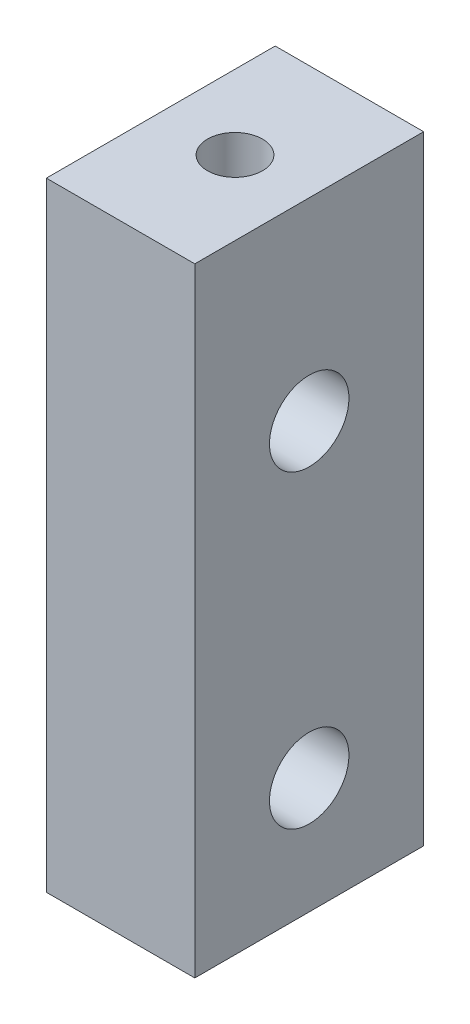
ISO-10303-21;
HEADER;
FILE_DESCRIPTION(('STEP AP214'),'2;1');
FILE_NAME('part.step','',(''),(''),'','','');
FILE_SCHEMA(('AUTOMOTIVE_DESIGN { 1 0 10303 214 1 1 1 1 }'));
ENDSEC;
DATA;
#1=APPLICATION_CONTEXT('core data for automotive mechanical design processes');
#2=APPLICATION_PROTOCOL_DEFINITION('international standard','automotive_design',2000,#1);
#3=PRODUCT_CONTEXT('',#1,'mechanical');
#4=PRODUCT('Part','Part','',(#3));
#5=PRODUCT_RELATED_PRODUCT_CATEGORY('part','',(#4));
#6=PRODUCT_DEFINITION_FORMATION('','',#4);
#7=PRODUCT_DEFINITION_CONTEXT('part definition',#1,'design');
#8=PRODUCT_DEFINITION('design','',#6,#7);
#9=PRODUCT_DEFINITION_SHAPE('','',#8);
#10=(LENGTH_UNIT() NAMED_UNIT(*) SI_UNIT(.MILLI.,.METRE.));
#11=(NAMED_UNIT(*) PLANE_ANGLE_UNIT() SI_UNIT($,.RADIAN.));
#12=(NAMED_UNIT(*) SI_UNIT($,.STERADIAN.) SOLID_ANGLE_UNIT());
#13=UNCERTAINTY_MEASURE_WITH_UNIT(LENGTH_MEASURE(1.E-05),#10,'distance_accuracy_value','');
#14=(GEOMETRIC_REPRESENTATION_CONTEXT(3) GLOBAL_UNCERTAINTY_ASSIGNED_CONTEXT((#13)) GLOBAL_UNIT_ASSIGNED_CONTEXT((#10,
#11,#12)) REPRESENTATION_CONTEXT('',''));
#15=CARTESIAN_POINT('',(0.,0.,0.));
#16=DIRECTION('',(0.,0.,1.));
#17=DIRECTION('',(1.,0.,0.));
#18=AXIS2_PLACEMENT_3D('',#15,#16,#17);
#19=CARTESIAN_POINT('',(6.096,0.,0.));
#20=DIRECTION('',(0.,0.,-0.999999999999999));
#21=DIRECTION('',(0.,0.999999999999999,0.));
#22=AXIS2_PLACEMENT_3D('',#19,#20,#21);
#23=PLANE('',#22);
#24=DIRECTION('',(0.,-0.999999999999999,0.));
#25=VECTOR('',#24,1.);
#26=CARTESIAN_POINT('',(0.,0.,0.));
#27=LINE('',#26,#25);
#28=CARTESIAN_POINT('',(0.,0.,0.));
#29=VERTEX_POINT('',#28);
#30=CARTESIAN_POINT('',(0.,-25.4,0.));
#31=VERTEX_POINT('',#30);
#32=EDGE_CURVE('E133',#29,#31,#27,.T.);
#33=ORIENTED_EDGE('',*,*,#32,.T.);
#34=DIRECTION('',(-1.,0.,0.));
#35=VECTOR('',#34,1.);
#36=CARTESIAN_POINT('',(6.09599999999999,-25.4,0.));
#37=LINE('',#36,#35);
#38=CARTESIAN_POINT('',(6.09599999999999,-25.4,0.));
#39=VERTEX_POINT('',#38);
#40=EDGE_CURVE('E11',#39,#31,#37,.T.);
#41=ORIENTED_EDGE('',*,*,#40,.F.);
#42=DIRECTION('',(0.,-0.999999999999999,0.));
#43=VECTOR('',#42,1.);
#44=CARTESIAN_POINT('',(6.096,0.,0.));
#45=LINE('',#44,#43);
#46=CARTESIAN_POINT('',(6.096,0.,0.));
#47=VERTEX_POINT('',#46);
#48=EDGE_CURVE('E134',#47,#39,#45,.T.);
#49=ORIENTED_EDGE('',*,*,#48,.F.);
#50=DIRECTION('',(-1.,0.,0.));
#51=VECTOR('',#50,1.);
#52=CARTESIAN_POINT('',(6.096,0.,0.));
#53=LINE('',#52,#51);
#54=EDGE_CURVE('E143',#47,#29,#53,.T.);
#55=ORIENTED_EDGE('',*,*,#54,.T.);
#56=EDGE_LOOP('',(#33,#41,#49,#55));
#57=FACE_BOUND('',#56,.T.);
#58=ADVANCED_FACE('F46',(#57),#23,.F.);
#59=CARTESIAN_POINT('',(6.09599999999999,-25.4,0.));
#60=DIRECTION('',(0.,0.999999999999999,0.));
#61=DIRECTION('',(0.,0.,0.999999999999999));
#62=AXIS2_PLACEMENT_3D('',#59,#60,#61);
#63=PLANE('',#62);
#64=DIRECTION('',(0.,0.,-0.999999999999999));
#65=VECTOR('',#64,1.);
#66=CARTESIAN_POINT('',(0.,-25.4,0.));
#67=LINE('',#66,#65);
#68=CARTESIAN_POINT('',(0.,-25.4,-9.39799999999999));
#69=VERTEX_POINT('',#68);
#70=EDGE_CURVE('E147',#31,#69,#67,.T.);
#71=ORIENTED_EDGE('',*,*,#70,.T.);
#72=DIRECTION('',(-1.,0.,0.));
#73=VECTOR('',#72,1.);
#74=CARTESIAN_POINT('',(6.09600000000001,-25.4,-9.39799999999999));
#75=LINE('',#74,#73);
#76=CARTESIAN_POINT('',(6.09600000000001,-25.4,-9.39799999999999));
#77=VERTEX_POINT('',#76);
#78=EDGE_CURVE('E56',#77,#69,#75,.T.);
#79=ORIENTED_EDGE('',*,*,#78,.F.);
#80=DIRECTION('',(0.,0.,-0.999999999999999));
#81=VECTOR('',#80,1.);
#82=CARTESIAN_POINT('',(6.09599999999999,-25.4,0.));
#83=LINE('',#82,#81);
#84=EDGE_CURVE('E99',#39,#77,#83,.T.);
#85=ORIENTED_EDGE('',*,*,#84,.F.);
#86=ORIENTED_EDGE('',*,*,#40,.T.);
#87=EDGE_LOOP('',(#71,#79,#85,#86));
#88=FACE_BOUND('',#87,.T.);
#89=ADVANCED_FACE('F175',(#88),#63,.F.);
#90=CARTESIAN_POINT('',(6.09600000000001,0.,-9.39799999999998));
#91=DIRECTION('',(0.,0.,0.999999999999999));
#92=DIRECTION('',(0.,-0.999999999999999,0.));
#93=AXIS2_PLACEMENT_3D('',#90,#91,#92);
#94=PLANE('',#93);
#95=DIRECTION('',(0.,0.999999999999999,0.));
#96=VECTOR('',#95,1.);
#97=CARTESIAN_POINT('',(0.,0.,-9.39799999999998));
#98=LINE('',#97,#96);
#99=CARTESIAN_POINT('',(0.,0.,-9.39799999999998));
#100=VERTEX_POINT('',#99);
#101=EDGE_CURVE('E84',#69,#100,#98,.T.);
#102=ORIENTED_EDGE('',*,*,#101,.T.);
#103=DIRECTION('',(-1.,0.,0.));
#104=VECTOR('',#103,1.);
#105=CARTESIAN_POINT('',(6.09600000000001,0.,-9.39799999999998));
#106=LINE('',#105,#104);
#107=CARTESIAN_POINT('',(6.09600000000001,0.,-9.39799999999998));
#108=VERTEX_POINT('',#107);
#109=EDGE_CURVE('E153',#108,#100,#106,.T.);
#110=ORIENTED_EDGE('',*,*,#109,.F.);
#111=DIRECTION('',(0.,0.999999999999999,0.));
#112=VECTOR('',#111,1.);
#113=CARTESIAN_POINT('',(6.09600000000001,0.,-9.39799999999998));
#114=LINE('',#113,#112);
#115=EDGE_CURVE('E139',#77,#108,#114,.T.);
#116=ORIENTED_EDGE('',*,*,#115,.F.);
#117=ORIENTED_EDGE('',*,*,#78,.T.);
#118=EDGE_LOOP('',(#102,#110,#116,#117));
#119=FACE_BOUND('',#118,.T.);
#120=ADVANCED_FACE('F157',(#119),#94,.F.);
#121=CARTESIAN_POINT('',(6.096,0.,0.));
#122=DIRECTION('',(0.,-0.999999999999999,0.));
#123=DIRECTION('',(0.,0.,-0.999999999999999));
#124=AXIS2_PLACEMENT_3D('',#121,#122,#123);
#125=PLANE('',#124);
#126=CARTESIAN_POINT('',(3.04800000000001,0.,-4.69899999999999));
#127=DIRECTION('',(0.,0.999999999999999,0.));
#128=DIRECTION('',(0.,0.,0.999999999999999));
#129=AXIS2_PLACEMENT_3D('',#126,#127,#128);
#130=CIRCLE('',#129,1.13029999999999);
#131=CARTESIAN_POINT('',(3.04800000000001,0.,-3.5687));
#132=VERTEX_POINT('',#131);
#133=EDGE_CURVE('E116',#132,#132,#130,.T.);
#134=ORIENTED_EDGE('',*,*,#133,.F.);
#135=EDGE_LOOP('',(#134));
#136=FACE_BOUND('',#135,.T.);
#137=DIRECTION('',(0.,0.,0.999999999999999));
#138=VECTOR('',#137,1.);
#139=CARTESIAN_POINT('',(0.,0.,0.));
#140=LINE('',#139,#138);
#141=EDGE_CURVE('E90',#100,#29,#140,.T.);
#142=ORIENTED_EDGE('',*,*,#141,.T.);
#143=ORIENTED_EDGE('',*,*,#54,.F.);
#144=DIRECTION('',(0.,0.,0.999999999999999));
#145=VECTOR('',#144,1.);
#146=CARTESIAN_POINT('',(6.096,0.,0.));
#147=LINE('',#146,#145);
#148=EDGE_CURVE('E64',#108,#47,#147,.T.);
#149=ORIENTED_EDGE('',*,*,#148,.F.);
#150=ORIENTED_EDGE('',*,*,#109,.T.);
#151=EDGE_LOOP('',(#142,#143,#149,#150));
#152=FACE_BOUND('',#151,.T.);
#153=ADVANCED_FACE('F164',(#136,#152),#125,.F.);
#154=CARTESIAN_POINT('',(6.09599999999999,-25.4,0.));
#155=DIRECTION('',(1.,0.,0.));
#156=DIRECTION('',(0.,0.,-0.999999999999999));
#157=AXIS2_PLACEMENT_3D('',#154,#155,#156);
#158=PLANE('',#157);
#159=CARTESIAN_POINT('',(6.096,-7.9375,-4.69900000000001));
#160=DIRECTION('',(1.,0.,0.));
#161=DIRECTION('',(0.,0.,-0.999999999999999));
#162=AXIS2_PLACEMENT_3D('',#159,#160,#161);
#163=CIRCLE('',#162,1.63195);
#164=CARTESIAN_POINT('',(6.096,-7.9375,-6.33095));
#165=VERTEX_POINT('',#164);
#166=EDGE_CURVE('E115',#165,#165,#163,.T.);
#167=ORIENTED_EDGE('',*,*,#166,.F.);
#168=EDGE_LOOP('',(#167));
#169=FACE_BOUND('',#168,.T.);
#170=CARTESIAN_POINT('',(6.096,-20.6375,-4.69900000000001));
#171=DIRECTION('',(1.,0.,0.));
#172=DIRECTION('',(0.,0.,-0.999999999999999));
#173=AXIS2_PLACEMENT_3D('',#170,#171,#172);
#174=CIRCLE('',#173,1.63195);
#175=CARTESIAN_POINT('',(6.096,-20.6375,-6.33095000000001));
#176=VERTEX_POINT('',#175);
#177=EDGE_CURVE('E125',#176,#176,#174,.T.);
#178=ORIENTED_EDGE('',*,*,#177,.F.);
#179=EDGE_LOOP('',(#178));
#180=FACE_BOUND('',#179,.T.);
#181=ORIENTED_EDGE('',*,*,#48,.T.);
#182=ORIENTED_EDGE('',*,*,#84,.T.);
#183=ORIENTED_EDGE('',*,*,#115,.T.);
#184=ORIENTED_EDGE('',*,*,#148,.T.);
#185=EDGE_LOOP('',(#181,#182,#183,#184));
#186=FACE_BOUND('',#185,.T.);
#187=ADVANCED_FACE('F166',(#169,#180,#186),#158,.T.);
#188=CARTESIAN_POINT('',(0.,-25.4,0.));
#189=DIRECTION('',(1.,0.,0.));
#190=DIRECTION('',(0.,0.,-0.999999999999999));
#191=AXIS2_PLACEMENT_3D('',#188,#189,#190);
#192=PLANE('',#191);
#193=CARTESIAN_POINT('',(0.,-7.9375,-4.699));
#194=DIRECTION('',(1.,0.,0.));
#195=DIRECTION('',(0.,0.,-0.999999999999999));
#196=AXIS2_PLACEMENT_3D('',#193,#194,#195);
#197=CIRCLE('',#196,1.63195);
#198=CARTESIAN_POINT('',(0.,-7.9375,-6.33095));
#199=VERTEX_POINT('',#198);
#200=EDGE_CURVE('E49',#199,#199,#197,.T.);
#201=ORIENTED_EDGE('',*,*,#200,.T.);
#202=EDGE_LOOP('',(#201));
#203=FACE_BOUND('',#202,.T.);
#204=CARTESIAN_POINT('',(0.,-20.6375,-4.699));
#205=DIRECTION('',(1.,0.,0.));
#206=DIRECTION('',(0.,0.,-0.999999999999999));
#207=AXIS2_PLACEMENT_3D('',#204,#205,#206);
#208=CIRCLE('',#207,1.63195);
#209=CARTESIAN_POINT('',(0.,-20.6375,-6.33095));
#210=VERTEX_POINT('',#209);
#211=EDGE_CURVE('E129',#210,#210,#208,.T.);
#212=ORIENTED_EDGE('',*,*,#211,.T.);
#213=EDGE_LOOP('',(#212));
#214=FACE_BOUND('',#213,.T.);
#215=ORIENTED_EDGE('',*,*,#32,.F.);
#216=ORIENTED_EDGE('',*,*,#141,.F.);
#217=ORIENTED_EDGE('',*,*,#101,.F.);
#218=ORIENTED_EDGE('',*,*,#70,.F.);
#219=EDGE_LOOP('',(#215,#216,#217,#218));
#220=FACE_BOUND('',#219,.T.);
#221=ADVANCED_FACE('F160',(#203,#214,#220),#192,.F.);
#222=CARTESIAN_POINT('',(6.096,-20.6375,-4.69900000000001));
#223=DIRECTION('',(1.,0.,0.));
#224=DIRECTION('',(0.,0.,-0.999999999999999));
#225=AXIS2_PLACEMENT_3D('',#222,#223,#224);
#226=CYLINDRICAL_SURFACE('',#225,1.63195);
#227=ORIENTED_EDGE('',*,*,#177,.T.);
#228=EDGE_LOOP('',(#227));
#229=FACE_BOUND('',#228,.T.);
#230=ORIENTED_EDGE('',*,*,#211,.F.);
#231=EDGE_LOOP('',(#230));
#232=FACE_BOUND('',#231,.T.);
#233=ADVANCED_FACE('F211',(#229,#232),#226,.F.);
#234=CARTESIAN_POINT('',(6.096,-7.9375,-4.69900000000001));
#235=DIRECTION('',(1.,0.,0.));
#236=DIRECTION('',(0.,0.,-0.999999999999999));
#237=AXIS2_PLACEMENT_3D('',#234,#235,#236);
#238=CYLINDRICAL_SURFACE('',#237,1.63195);
#239=ORIENTED_EDGE('',*,*,#166,.T.);
#240=EDGE_LOOP('',(#239));
#241=FACE_BOUND('',#240,.T.);
#242=ORIENTED_EDGE('',*,*,#200,.F.);
#243=EDGE_LOOP('',(#242));
#244=FACE_BOUND('',#243,.T.);
#245=ADVANCED_FACE('F108',(#241,#244),#238,.F.);
#246=CARTESIAN_POINT('',(3.048,-5.08,-4.69899999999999));
#247=DIRECTION('',(0.,0.999999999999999,0.));
#248=DIRECTION('',(0.,0.,0.999999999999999));
#249=AXIS2_PLACEMENT_3D('',#246,#247,#248);
#250=CONICAL_SURFACE('',#249,1.13029999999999,1.02974425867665);
#251=CARTESIAN_POINT('',(3.048,-5.75915275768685,-4.69899999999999));
#252=VERTEX_POINT('',#251);
#253=VERTEX_LOOP('',#252);
#254=FACE_BOUND('',#253,.T.);
#255=CARTESIAN_POINT('',(3.048,-5.08,-4.69899999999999));
#256=DIRECTION('',(0.,0.999999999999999,0.));
#257=DIRECTION('',(0.,0.,0.999999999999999));
#258=AXIS2_PLACEMENT_3D('',#255,#256,#257);
#259=CIRCLE('',#258,1.13029999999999);
#260=CARTESIAN_POINT('',(3.04800000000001,-5.08,-3.5687));
#261=VERTEX_POINT('',#260);
#262=EDGE_CURVE('E112',#261,#261,#259,.T.);
#263=ORIENTED_EDGE('',*,*,#262,.T.);
#264=EDGE_LOOP('',(#263));
#265=FACE_BOUND('',#264,.T.);
#266=ADVANCED_FACE('F104',(#254,#265),#250,.F.);
#267=CARTESIAN_POINT('',(3.04800000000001,0.,-4.69899999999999));
#268=DIRECTION('',(0.,0.999999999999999,0.));
#269=DIRECTION('',(0.,0.,0.999999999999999));
#270=AXIS2_PLACEMENT_3D('',#267,#268,#269);
#271=CYLINDRICAL_SURFACE('',#270,1.13029999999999);
#272=CARTESIAN_POINT('',(3.04800000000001,-5.08,-3.5687));
#273=CARTESIAN_POINT('',(3.04800000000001,-5.02708333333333,-3.5687));
#274=CARTESIAN_POINT('',(3.04800000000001,-4.97416666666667,-3.5687));
#275=CARTESIAN_POINT('',(3.04800000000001,-4.86833333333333,-3.5687));
#276=CARTESIAN_POINT('',(3.04800000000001,-4.81541666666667,-3.5687));
#277=CARTESIAN_POINT('',(3.04800000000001,-4.70958333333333,-3.5687));
#278=CARTESIAN_POINT('',(3.04800000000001,-4.65666666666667,-3.5687));
#279=CARTESIAN_POINT('',(3.04800000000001,-4.55083333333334,-3.5687));
#280=CARTESIAN_POINT('',(3.04800000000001,-4.49791666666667,-3.5687));
#281=CARTESIAN_POINT('',(3.04800000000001,-4.39208333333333,-3.5687));
#282=CARTESIAN_POINT('',(3.04800000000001,-4.33916666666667,-3.5687));
#283=CARTESIAN_POINT('',(3.04800000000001,-4.23333333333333,-3.5687));
#284=CARTESIAN_POINT('',(3.04800000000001,-4.18041666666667,-3.5687));
#285=CARTESIAN_POINT('',(3.04800000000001,-4.07458333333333,-3.5687));
#286=CARTESIAN_POINT('',(3.04800000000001,-4.02166666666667,-3.5687));
#287=CARTESIAN_POINT('',(3.04800000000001,-3.91583333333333,-3.5687));
#288=CARTESIAN_POINT('',(3.04800000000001,-3.86291666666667,-3.5687));
#289=CARTESIAN_POINT('',(3.04800000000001,-3.75708333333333,-3.5687));
#290=CARTESIAN_POINT('',(3.04800000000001,-3.70416666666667,-3.5687));
#291=CARTESIAN_POINT('',(3.04800000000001,-3.59833333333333,-3.5687));
#292=CARTESIAN_POINT('',(3.04800000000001,-3.54541666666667,-3.5687));
#293=CARTESIAN_POINT('',(3.04800000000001,-3.43958333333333,-3.5687));
#294=CARTESIAN_POINT('',(3.04800000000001,-3.38666666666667,-3.5687));
#295=CARTESIAN_POINT('',(3.04800000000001,-3.28083333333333,-3.5687));
#296=CARTESIAN_POINT('',(3.04800000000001,-3.22791666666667,-3.5687));
#297=CARTESIAN_POINT('',(3.04800000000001,-3.12208333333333,-3.5687));
#298=CARTESIAN_POINT('',(3.04800000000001,-3.06916666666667,-3.5687));
#299=CARTESIAN_POINT('',(3.04800000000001,-2.96333333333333,-3.5687));
#300=CARTESIAN_POINT('',(3.04800000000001,-2.91041666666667,-3.5687));
#301=CARTESIAN_POINT('',(3.04800000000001,-2.80458333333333,-3.5687));
#302=CARTESIAN_POINT('',(3.04800000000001,-2.75166666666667,-3.5687));
#303=CARTESIAN_POINT('',(3.04800000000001,-2.64583333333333,-3.5687));
#304=CARTESIAN_POINT('',(3.04800000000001,-2.59291666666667,-3.5687));
#305=CARTESIAN_POINT('',(3.04800000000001,-2.48708333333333,-3.5687));
#306=CARTESIAN_POINT('',(3.04800000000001,-2.43416666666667,-3.5687));
#307=CARTESIAN_POINT('',(3.04800000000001,-2.32833333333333,-3.5687));
#308=CARTESIAN_POINT('',(3.04800000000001,-2.27541666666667,-3.5687));
#309=CARTESIAN_POINT('',(3.04800000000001,-2.16958333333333,-3.5687));
#310=CARTESIAN_POINT('',(3.04800000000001,-2.11666666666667,-3.5687));
#311=CARTESIAN_POINT('',(3.04800000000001,-2.01083333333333,-3.5687));
#312=CARTESIAN_POINT('',(3.04800000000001,-1.95791666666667,-3.5687));
#313=CARTESIAN_POINT('',(3.04800000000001,-1.85208333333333,-3.5687));
#314=CARTESIAN_POINT('',(3.04800000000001,-1.79916666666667,-3.5687));
#315=CARTESIAN_POINT('',(3.04800000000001,-1.69333333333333,-3.5687));
#316=CARTESIAN_POINT('',(3.04800000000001,-1.64041666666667,-3.5687));
#317=CARTESIAN_POINT('',(3.04800000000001,-1.53458333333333,-3.5687));
#318=CARTESIAN_POINT('',(3.04800000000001,-1.48166666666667,-3.5687));
#319=CARTESIAN_POINT('',(3.04800000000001,-1.37583333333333,-3.5687));
#320=CARTESIAN_POINT('',(3.04800000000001,-1.32291666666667,-3.5687));
#321=CARTESIAN_POINT('',(3.04800000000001,-1.21708333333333,-3.5687));
#322=CARTESIAN_POINT('',(3.04800000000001,-1.16416666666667,-3.5687));
#323=CARTESIAN_POINT('',(3.04800000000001,-1.05833333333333,-3.5687));
#324=CARTESIAN_POINT('',(3.04800000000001,-1.00541666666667,-3.5687));
#325=CARTESIAN_POINT('',(3.04800000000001,-0.899583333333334,-3.5687));
#326=CARTESIAN_POINT('',(3.04800000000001,-0.846666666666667,-3.5687));
#327=CARTESIAN_POINT('',(3.04800000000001,-0.740833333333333,-3.5687));
#328=CARTESIAN_POINT('',(3.04800000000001,-0.687916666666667,-3.5687));
#329=CARTESIAN_POINT('',(3.04800000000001,-0.582083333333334,-3.5687));
#330=CARTESIAN_POINT('',(3.04800000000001,-0.529166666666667,-3.5687));
#331=CARTESIAN_POINT('',(3.04800000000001,-0.423333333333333,-3.5687));
#332=CARTESIAN_POINT('',(3.04800000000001,-0.370416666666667,-3.5687));
#333=CARTESIAN_POINT('',(3.04800000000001,-0.264583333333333,-3.5687));
#334=CARTESIAN_POINT('',(3.04800000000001,-0.211666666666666,-3.5687));
#335=CARTESIAN_POINT('',(3.04800000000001,-0.105833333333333,-3.5687));
#336=CARTESIAN_POINT('',(3.04800000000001,-0.0529166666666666,-3.5687));
#337=CARTESIAN_POINT('',(3.04800000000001,0.,-3.5687));
#338=B_SPLINE_CURVE_WITH_KNOTS('',3,(#272,#273,#274,#275,#276,#277,#278,#279,#280,#281,#282,
#283,#284,#285,#286,#287,#288,#289,#290,#291,#292,#293,#294,#295,#296,#297,#298,#299,#300,#301,
#302,#303,#304,#305,#306,#307,#308,#309,#310,#311,#312,#313,#314,#315,#316,#317,#318,#319,#320,
#321,#322,#323,#324,#325,#326,#327,#328,#329,#330,#331,#332,#333,#334,#335,#336,#337),
.UNSPECIFIED.,.F.,.F.,(4,2,2,2,2,2,2,2,2,2,2,2,2,2,2,2,2,2,2,2,2,2,2,2,2,2,2,2,2,2,2,2,4),(0.,
0.15875,0.317499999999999,0.47625,0.635,0.79375,0.9525,1.11125,1.27,1.42875,1.5875,1.74625,
1.905,2.06375,2.2225,2.38125,2.54,2.69875,2.8575,3.01625,3.175,3.33375,3.4925,3.65125,3.81,
3.96875,4.1275,4.28625,4.445,4.60375,4.7625,4.92125,5.08),.UNSPECIFIED.);
#339=EDGE_CURVE('BSEAM107',#261,#132,#338,.T.);
#340=ORIENTED_EDGE('',*,*,#262,.F.);
#341=ORIENTED_EDGE('',*,*,#133,.T.);
#342=ORIENTED_EDGE('',*,*,#339,.T.);
#343=ORIENTED_EDGE('',*,*,#339,.F.);
#344=EDGE_LOOP('',(#340,#342,#341,#343));
#345=FACE_BOUND('',#344,.T.);
#346=ADVANCED_FACE('F107',(#345),#271,.F.);
#347=CLOSED_SHELL('',(#58,#89,#120,#153,#187,#221,#233,#245,#266,#346));
#348=MANIFOLD_SOLID_BREP('B2',#347);
#349=ADVANCED_BREP_SHAPE_REPRESENTATION('',(#18,#348),#14);
#350=SHAPE_DEFINITION_REPRESENTATION(#9,#349);
ENDSEC;
END-ISO-10303-21;
